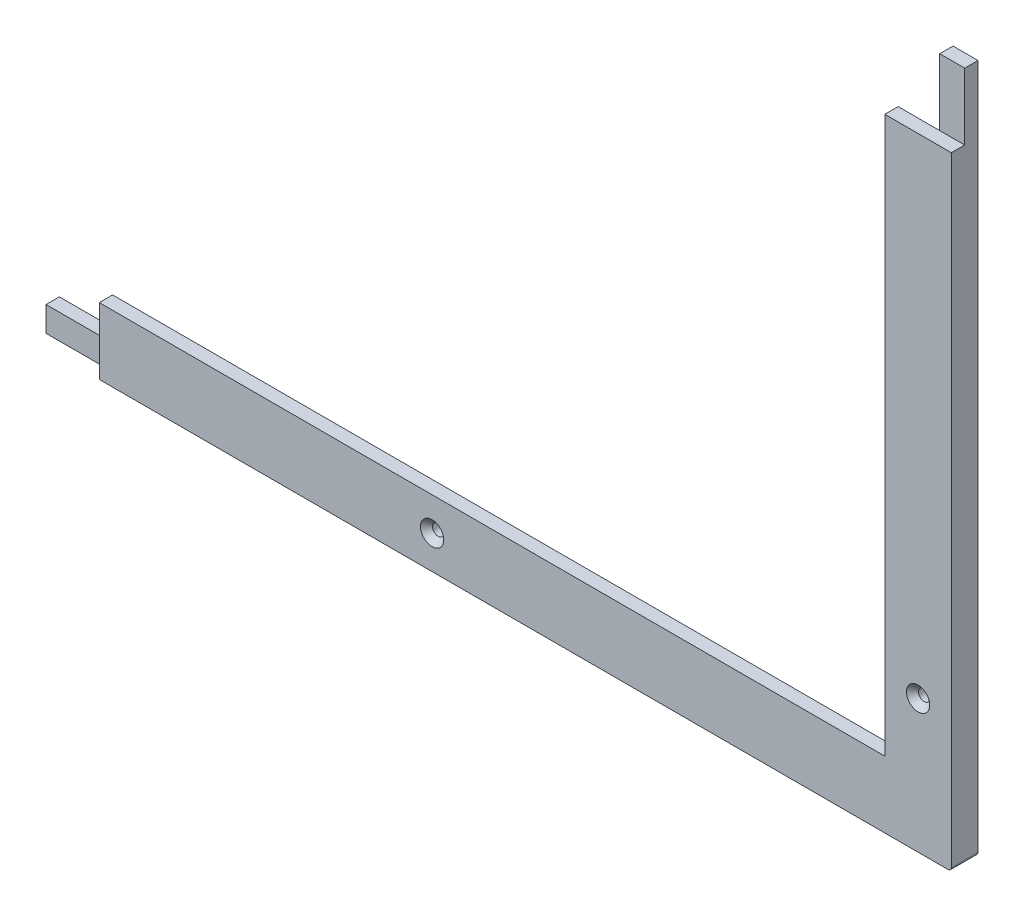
ISO-10303-21;
HEADER;
FILE_DESCRIPTION(('STEP AP214'),'2;1');
FILE_NAME('part.step','',(''),(''),'','','');
FILE_SCHEMA(('AUTOMOTIVE_DESIGN { 1 0 10303 214 1 1 1 1 }'));
ENDSEC;
DATA;
#1=APPLICATION_CONTEXT('core data for automotive mechanical design processes');
#2=APPLICATION_PROTOCOL_DEFINITION('international standard','automotive_design',2000,#1);
#3=PRODUCT_CONTEXT('',#1,'mechanical');
#4=PRODUCT('Part','Part','',(#3));
#5=PRODUCT_RELATED_PRODUCT_CATEGORY('part','',(#4));
#6=PRODUCT_DEFINITION_FORMATION('','',#4);
#7=PRODUCT_DEFINITION_CONTEXT('part definition',#1,'design');
#8=PRODUCT_DEFINITION('design','',#6,#7);
#9=PRODUCT_DEFINITION_SHAPE('','',#8);
#10=(LENGTH_UNIT() NAMED_UNIT(*) SI_UNIT(.MILLI.,.METRE.));
#11=(NAMED_UNIT(*) PLANE_ANGLE_UNIT() SI_UNIT($,.RADIAN.));
#12=(NAMED_UNIT(*) SI_UNIT($,.STERADIAN.) SOLID_ANGLE_UNIT());
#13=UNCERTAINTY_MEASURE_WITH_UNIT(LENGTH_MEASURE(1.E-05),#10,'distance_accuracy_value','');
#14=(GEOMETRIC_REPRESENTATION_CONTEXT(3) GLOBAL_UNCERTAINTY_ASSIGNED_CONTEXT((#13)) GLOBAL_UNIT_ASSIGNED_CONTEXT((#10,
#11,#12)) REPRESENTATION_CONTEXT('',''));
#15=CARTESIAN_POINT('',(0.,0.,0.));
#16=DIRECTION('',(0.,0.,1.));
#17=DIRECTION('',(1.,0.,0.));
#18=AXIS2_PLACEMENT_3D('',#15,#16,#17);
#19=CARTESIAN_POINT('',(246.,-177.,8.));
#20=DIRECTION('',(-1.,0.,0.));
#21=DIRECTION('',(0.,0.,1.));
#22=AXIS2_PLACEMENT_3D('',#19,#20,#21);
#23=PLANE('',#22);
#24=DIRECTION('',(0.,1.,0.));
#25=VECTOR('',#24,1.);
#26=CARTESIAN_POINT('',(246.,-177.,8.));
#27=LINE('',#26,#25);
#28=CARTESIAN_POINT('',(246.,-177.,8.));
#29=VERTEX_POINT('',#28);
#30=CARTESIAN_POINT('',(246.,-10.,7.99999999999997));
#31=VERTEX_POINT('',#30);
#32=EDGE_CURVE('E245',#29,#31,#27,.T.);
#33=ORIENTED_EDGE('',*,*,#32,.T.);
#34=DIRECTION('',(0.,0.,-1.));
#35=VECTOR('',#34,1.);
#36=CARTESIAN_POINT('',(246.,-10.,8.00000000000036));
#37=LINE('',#36,#35);
#38=CARTESIAN_POINT('',(246.,-10.,4.));
#39=VERTEX_POINT('',#38);
#40=EDGE_CURVE('E217',#31,#39,#37,.T.);
#41=ORIENTED_EDGE('',*,*,#40,.T.);
#42=DIRECTION('',(0.,-1.,0.));
#43=VECTOR('',#42,1.);
#44=CARTESIAN_POINT('',(246.,-177.,4.));
#45=LINE('',#44,#43);
#46=CARTESIAN_POINT('',(246.,-177.,4.));
#47=VERTEX_POINT('',#46);
#48=EDGE_CURVE('E242',#39,#47,#45,.T.);
#49=ORIENTED_EDGE('',*,*,#48,.T.);
#50=DIRECTION('',(0.,0.,-1.));
#51=VECTOR('',#50,1.);
#52=CARTESIAN_POINT('',(246.,-177.,8.));
#53=LINE('',#52,#51);
#54=EDGE_CURVE('E178',#29,#47,#53,.T.);
#55=ORIENTED_EDGE('',*,*,#54,.F.);
#56=EDGE_LOOP('',(#33,#41,#49,#55));
#57=FACE_BOUND('',#56,.T.);
#58=ADVANCED_FACE('F38',(#57),#23,.T.);
#59=CARTESIAN_POINT('',(0.,0.,8.));
#60=DIRECTION('',(0.,0.,-1.));
#61=DIRECTION('',(-1.,0.,0.));
#62=AXIS2_PLACEMENT_3D('',#59,#60,#61);
#63=PLANE('',#62);
#64=CARTESIAN_POINT('',(256.,-157.,8.));
#65=DIRECTION('',(0.,0.,1.));
#66=DIRECTION('',(1.,0.,0.));
#67=AXIS2_PLACEMENT_3D('',#64,#65,#66);
#68=CIRCLE('',#67,3.5);
#69=CARTESIAN_POINT('',(259.5,-157.,8.));
#70=VERTEX_POINT('',#69);
#71=EDGE_CURVE('E200',#70,#70,#68,.T.);
#72=ORIENTED_EDGE('',*,*,#71,.F.);
#73=EDGE_LOOP('',(#72));
#74=FACE_BOUND('',#73,.T.);
#75=CARTESIAN_POINT('',(110.,-187.,8.));
#76=DIRECTION('',(0.,0.,1.));
#77=DIRECTION('',(1.,0.,0.));
#78=AXIS2_PLACEMENT_3D('',#75,#76,#77);
#79=CIRCLE('',#78,3.5);
#80=CARTESIAN_POINT('',(113.5,-187.,8.));
#81=VERTEX_POINT('',#80);
#82=EDGE_CURVE('E210',#81,#81,#79,.T.);
#83=ORIENTED_EDGE('',*,*,#82,.F.);
#84=EDGE_LOOP('',(#83));
#85=FACE_BOUND('',#84,.T.);
#86=DIRECTION('',(1.,0.,0.));
#87=VECTOR('',#86,1.);
#88=CARTESIAN_POINT('',(-246.,-177.,8.));
#89=LINE('',#88,#87);
#90=CARTESIAN_POINT('',(9.99999999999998,-177.,8.));
#91=VERTEX_POINT('',#90);
#92=EDGE_CURVE('E150',#91,#29,#89,.T.);
#93=ORIENTED_EDGE('',*,*,#92,.F.);
#94=DIRECTION('',(0.,1.,0.));
#95=VECTOR('',#94,1.);
#96=CARTESIAN_POINT('',(9.99999999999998,-197.,8.));
#97=LINE('',#96,#95);
#98=CARTESIAN_POINT('',(9.99999999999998,-197.,8.));
#99=VERTEX_POINT('',#98);
#100=EDGE_CURVE('E136',#99,#91,#97,.T.);
#101=ORIENTED_EDGE('',*,*,#100,.F.);
#102=DIRECTION('',(1.,0.,0.));
#103=VECTOR('',#102,1.);
#104=CARTESIAN_POINT('',(-266.,-197.,8.));
#105=LINE('',#104,#103);
#106=CARTESIAN_POINT('',(265.,-197.,8.));
#107=VERTEX_POINT('',#106);
#108=EDGE_CURVE('E147',#99,#107,#105,.T.);
#109=ORIENTED_EDGE('',*,*,#108,.T.);
#110=CARTESIAN_POINT('',(265.,-196.,8.));
#111=DIRECTION('',(0.,0.,-1.));
#112=DIRECTION('',(-1.,0.,0.));
#113=AXIS2_PLACEMENT_3D('',#110,#111,#112);
#114=CIRCLE('',#113,1.);
#115=CARTESIAN_POINT('',(266.,-196.,8.));
#116=VERTEX_POINT('',#115);
#117=EDGE_CURVE('E167',#107,#116,#114,.F.);
#118=ORIENTED_EDGE('',*,*,#117,.T.);
#119=DIRECTION('',(0.,1.,0.));
#120=VECTOR('',#119,1.);
#121=CARTESIAN_POINT('',(266.,-197.,8.));
#122=LINE('',#121,#120);
#123=CARTESIAN_POINT('',(266.,-10.,7.99999999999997));
#124=VERTEX_POINT('',#123);
#125=EDGE_CURVE('E161',#116,#124,#122,.T.);
#126=ORIENTED_EDGE('',*,*,#125,.T.);
#127=DIRECTION('',(-1.,0.,0.));
#128=VECTOR('',#127,1.);
#129=CARTESIAN_POINT('',(266.,-10.,7.99999999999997));
#130=LINE('',#129,#128);
#131=EDGE_CURVE('E261',#124,#31,#130,.T.);
#132=ORIENTED_EDGE('',*,*,#131,.T.);
#133=ORIENTED_EDGE('',*,*,#32,.F.);
#134=EDGE_LOOP('',(#93,#101,#109,#118,#126,#132,#133));
#135=FACE_BOUND('',#134,.T.);
#136=ADVANCED_FACE('F146',(#74,#85,#135),#63,.F.);
#137=CARTESIAN_POINT('',(0.,0.,0.));
#138=DIRECTION('',(0.,0.,-1.));
#139=DIRECTION('',(-1.,0.,0.));
#140=AXIS2_PLACEMENT_3D('',#137,#138,#139);
#141=PLANE('',#140);
#142=DIRECTION('',(0.,1.,0.));
#143=VECTOR('',#142,1.);
#144=CARTESIAN_POINT('',(-10.,-197.,0.));
#145=LINE('',#144,#143);
#146=CARTESIAN_POINT('',(-10.,-197.,0.));
#147=VERTEX_POINT('',#146);
#148=CARTESIAN_POINT('',(-10.,-189.5,0.));
#149=VERTEX_POINT('',#148);
#150=EDGE_CURVE('E299',#147,#149,#145,.T.);
#151=ORIENTED_EDGE('',*,*,#150,.T.);
#152=DIRECTION('',(-1.,0.,0.));
#153=VECTOR('',#152,1.);
#154=CARTESIAN_POINT('',(258.5,-189.5,0.));
#155=LINE('',#154,#153);
#156=CARTESIAN_POINT('',(258.5,-189.5,0.));
#157=VERTEX_POINT('',#156);
#158=EDGE_CURVE('E228',#157,#149,#155,.T.);
#159=ORIENTED_EDGE('',*,*,#158,.F.);
#160=DIRECTION('',(0.,-1.,0.));
#161=VECTOR('',#160,1.);
#162=CARTESIAN_POINT('',(258.5,189.5,0.));
#163=LINE('',#162,#161);
#164=CARTESIAN_POINT('',(258.5,10.,0.));
#165=VERTEX_POINT('',#164);
#166=EDGE_CURVE('E195',#165,#157,#163,.T.);
#167=ORIENTED_EDGE('',*,*,#166,.F.);
#168=DIRECTION('',(-1.,0.,0.));
#169=VECTOR('',#168,1.);
#170=CARTESIAN_POINT('',(266.,10.,0.));
#171=LINE('',#170,#169);
#172=CARTESIAN_POINT('',(266.,10.,0.));
#173=VERTEX_POINT('',#172);
#174=EDGE_CURVE('E308',#173,#165,#171,.T.);
#175=ORIENTED_EDGE('',*,*,#174,.F.);
#176=DIRECTION('',(0.,1.,0.));
#177=VECTOR('',#176,1.);
#178=CARTESIAN_POINT('',(266.,-197.,0.));
#179=LINE('',#178,#177);
#180=CARTESIAN_POINT('',(266.,-196.,0.));
#181=VERTEX_POINT('',#180);
#182=EDGE_CURVE('E174',#181,#173,#179,.T.);
#183=ORIENTED_EDGE('',*,*,#182,.F.);
#184=CARTESIAN_POINT('',(265.,-196.,0.));
#185=DIRECTION('',(0.,0.,-1.));
#186=DIRECTION('',(-1.,0.,0.));
#187=AXIS2_PLACEMENT_3D('',#184,#185,#186);
#188=CIRCLE('',#187,1.);
#189=CARTESIAN_POINT('',(265.,-197.,0.));
#190=VERTEX_POINT('',#189);
#191=EDGE_CURVE('E160',#181,#190,#188,.T.);
#192=ORIENTED_EDGE('',*,*,#191,.T.);
#193=DIRECTION('',(1.,0.,0.));
#194=VECTOR('',#193,1.);
#195=CARTESIAN_POINT('',(-266.,-197.,0.));
#196=LINE('',#195,#194);
#197=EDGE_CURVE('E170',#147,#190,#196,.T.);
#198=ORIENTED_EDGE('',*,*,#197,.F.);
#199=EDGE_LOOP('',(#151,#159,#167,#175,#183,#192,#198));
#200=FACE_BOUND('',#199,.T.);
#201=ADVANCED_FACE('F339',(#200),#141,.T.);
#202=CARTESIAN_POINT('',(266.,-197.,8.));
#203=DIRECTION('',(-1.,0.,0.));
#204=DIRECTION('',(0.,0.,1.));
#205=AXIS2_PLACEMENT_3D('',#202,#203,#204);
#206=PLANE('',#205);
#207=DIRECTION('',(0.,0.,-1.));
#208=VECTOR('',#207,1.);
#209=CARTESIAN_POINT('',(266.,-10.,7.99999999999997));
#210=LINE('',#209,#208);
#211=CARTESIAN_POINT('',(266.,-10.,4.));
#212=VERTEX_POINT('',#211);
#213=EDGE_CURVE('E298',#124,#212,#210,.T.);
#214=ORIENTED_EDGE('',*,*,#213,.F.);
#215=ORIENTED_EDGE('',*,*,#125,.F.);
#216=DIRECTION('',(0.,0.,-1.));
#217=VECTOR('',#216,1.);
#218=CARTESIAN_POINT('',(266.,-196.,8.));
#219=LINE('',#218,#217);
#220=EDGE_CURVE('E185',#116,#181,#219,.T.);
#221=ORIENTED_EDGE('',*,*,#220,.T.);
#222=ORIENTED_EDGE('',*,*,#182,.T.);
#223=DIRECTION('',(0.,0.,-1.));
#224=VECTOR('',#223,1.);
#225=CARTESIAN_POINT('',(266.,10.,4.));
#226=LINE('',#225,#224);
#227=CARTESIAN_POINT('',(266.,10.,4.));
#228=VERTEX_POINT('',#227);
#229=EDGE_CURVE('E305',#228,#173,#226,.T.);
#230=ORIENTED_EDGE('',*,*,#229,.F.);
#231=DIRECTION('',(0.,1.,0.));
#232=VECTOR('',#231,1.);
#233=CARTESIAN_POINT('',(266.,-10.,4.));
#234=LINE('',#233,#232);
#235=EDGE_CURVE('E302',#212,#228,#234,.T.);
#236=ORIENTED_EDGE('',*,*,#235,.F.);
#237=EDGE_LOOP('',(#214,#215,#221,#222,#230,#236));
#238=FACE_BOUND('',#237,.T.);
#239=ADVANCED_FACE('F347',(#238),#206,.F.);
#240=CARTESIAN_POINT('',(258.5,189.5,4.));
#241=DIRECTION('',(1.,0.,0.));
#242=DIRECTION('',(0.,1.,0.));
#243=AXIS2_PLACEMENT_3D('',#240,#241,#242);
#244=PLANE('',#243);
#245=DIRECTION('',(0.,0.,1.));
#246=VECTOR('',#245,1.);
#247=CARTESIAN_POINT('',(258.5,10.,3.99999999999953));
#248=LINE('',#247,#246);
#249=CARTESIAN_POINT('',(258.5,10.,4.));
#250=VERTEX_POINT('',#249);
#251=EDGE_CURVE('E270',#165,#250,#248,.T.);
#252=ORIENTED_EDGE('',*,*,#251,.F.);
#253=ORIENTED_EDGE('',*,*,#166,.T.);
#254=DIRECTION('',(0.,0.,-1.));
#255=VECTOR('',#254,1.);
#256=CARTESIAN_POINT('',(258.5,-189.5,4.));
#257=LINE('',#256,#255);
#258=CARTESIAN_POINT('',(258.5,-189.5,4.));
#259=VERTEX_POINT('',#258);
#260=EDGE_CURVE('E233',#259,#157,#257,.T.);
#261=ORIENTED_EDGE('',*,*,#260,.F.);
#262=DIRECTION('',(0.,-1.,0.));
#263=VECTOR('',#262,1.);
#264=CARTESIAN_POINT('',(258.5,189.5,4.));
#265=LINE('',#264,#263);
#266=CARTESIAN_POINT('',(258.5,-10.,4.));
#267=VERTEX_POINT('',#266);
#268=EDGE_CURVE('E224',#267,#259,#265,.T.);
#269=ORIENTED_EDGE('',*,*,#268,.F.);
#270=DIRECTION('',(0.,-1.,0.));
#271=VECTOR('',#270,1.);
#272=CARTESIAN_POINT('',(258.5,189.5,4.));
#273=LINE('',#272,#271);
#274=EDGE_CURVE('E265',#250,#267,#273,.T.);
#275=ORIENTED_EDGE('',*,*,#274,.F.);
#276=EDGE_LOOP('',(#252,#253,#261,#269,#275));
#277=FACE_BOUND('',#276,.T.);
#278=ADVANCED_FACE('F351',(#277),#244,.F.);
#279=CARTESIAN_POINT('',(0.,0.,4.));
#280=DIRECTION('',(0.,0.,-1.));
#281=DIRECTION('',(-1.,0.,0.));
#282=AXIS2_PLACEMENT_3D('',#279,#280,#281);
#283=PLANE('',#282);
#284=DIRECTION('',(0.,1.,0.));
#285=VECTOR('',#284,1.);
#286=CARTESIAN_POINT('',(10.,-197.,4.));
#287=LINE('',#286,#285);
#288=CARTESIAN_POINT('',(10.,-189.5,4.));
#289=VERTEX_POINT('',#288);
#290=CARTESIAN_POINT('',(10.,-177.,4.));
#291=VERTEX_POINT('',#290);
#292=EDGE_CURVE('E152',#289,#291,#287,.T.);
#293=ORIENTED_EDGE('',*,*,#292,.T.);
#294=DIRECTION('',(-1.,0.,0.));
#295=VECTOR('',#294,1.);
#296=CARTESIAN_POINT('',(-246.,-177.,4.));
#297=LINE('',#296,#295);
#298=EDGE_CURVE('E47',#47,#291,#297,.T.);
#299=ORIENTED_EDGE('',*,*,#298,.F.);
#300=ORIENTED_EDGE('',*,*,#48,.F.);
#301=DIRECTION('',(-1.,0.,0.));
#302=VECTOR('',#301,1.);
#303=CARTESIAN_POINT('',(266.,-10.,4.));
#304=LINE('',#303,#302);
#305=EDGE_CURVE('E272',#267,#39,#304,.T.);
#306=ORIENTED_EDGE('',*,*,#305,.F.);
#307=ORIENTED_EDGE('',*,*,#268,.T.);
#308=DIRECTION('',(-1.,0.,0.));
#309=VECTOR('',#308,1.);
#310=CARTESIAN_POINT('',(258.5,-189.5,4.));
#311=LINE('',#310,#309);
#312=EDGE_CURVE('E229',#259,#289,#311,.T.);
#313=ORIENTED_EDGE('',*,*,#312,.T.);
#314=EDGE_LOOP('',(#293,#299,#300,#306,#307,#313));
#315=FACE_BOUND('',#314,.T.);
#316=CARTESIAN_POINT('',(110.,-187.,4.));
#317=DIRECTION('',(0.,0.,-1.));
#318=DIRECTION('',(-1.,0.,0.));
#319=AXIS2_PLACEMENT_3D('',#316,#317,#318);
#320=CIRCLE('',#319,1.69999999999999);
#321=CARTESIAN_POINT('',(108.3,-187.,4.));
#322=VERTEX_POINT('',#321);
#323=EDGE_CURVE('E197',#322,#322,#320,.T.);
#324=ORIENTED_EDGE('',*,*,#323,.F.);
#325=EDGE_LOOP('',(#324));
#326=FACE_BOUND('',#325,.T.);
#327=CARTESIAN_POINT('',(256.,-157.,4.));
#328=DIRECTION('',(0.,0.,-1.));
#329=DIRECTION('',(-1.,0.,0.));
#330=AXIS2_PLACEMENT_3D('',#327,#328,#329);
#331=CIRCLE('',#330,1.69999999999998);
#332=CARTESIAN_POINT('',(254.3,-157.,4.));
#333=VERTEX_POINT('',#332);
#334=EDGE_CURVE('E192',#333,#333,#331,.T.);
#335=ORIENTED_EDGE('',*,*,#334,.F.);
#336=EDGE_LOOP('',(#335));
#337=FACE_BOUND('',#336,.T.);
#338=ADVANCED_FACE('F282',(#315,#326,#337),#283,.T.);
#339=CARTESIAN_POINT('',(-246.,-177.,8.));
#340=DIRECTION('',(0.,1.,0.));
#341=DIRECTION('',(0.,0.,1.));
#342=AXIS2_PLACEMENT_3D('',#339,#340,#341);
#343=PLANE('',#342);
#344=DIRECTION('',(0.,0.,-1.));
#345=VECTOR('',#344,1.);
#346=CARTESIAN_POINT('',(9.99999999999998,-177.,8.00000000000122));
#347=LINE('',#346,#345);
#348=EDGE_CURVE('E295',#91,#291,#347,.T.);
#349=ORIENTED_EDGE('',*,*,#348,.F.);
#350=ORIENTED_EDGE('',*,*,#92,.T.);
#351=ORIENTED_EDGE('',*,*,#54,.T.);
#352=ORIENTED_EDGE('',*,*,#298,.T.);
#353=EDGE_LOOP('',(#349,#350,#351,#352));
#354=FACE_BOUND('',#353,.T.);
#355=ADVANCED_FACE('F255',(#354),#343,.T.);
#356=CARTESIAN_POINT('',(-266.,-197.,8.));
#357=DIRECTION('',(0.,1.,0.));
#358=DIRECTION('',(0.,0.,1.));
#359=AXIS2_PLACEMENT_3D('',#356,#357,#358);
#360=PLANE('',#359);
#361=DIRECTION('',(-1.,0.,0.));
#362=VECTOR('',#361,1.);
#363=CARTESIAN_POINT('',(-10.,-197.,4.));
#364=LINE('',#363,#362);
#365=CARTESIAN_POINT('',(10.,-197.,4.));
#366=VERTEX_POINT('',#365);
#367=CARTESIAN_POINT('',(-10.,-197.,4.));
#368=VERTEX_POINT('',#367);
#369=EDGE_CURVE('E142',#366,#368,#364,.T.);
#370=ORIENTED_EDGE('',*,*,#369,.T.);
#371=DIRECTION('',(0.,0.,-1.));
#372=VECTOR('',#371,1.);
#373=CARTESIAN_POINT('',(-10.,-197.,0.));
#374=LINE('',#373,#372);
#375=EDGE_CURVE('E153',#368,#147,#374,.T.);
#376=ORIENTED_EDGE('',*,*,#375,.T.);
#377=ORIENTED_EDGE('',*,*,#197,.T.);
#378=DIRECTION('',(0.,0.,-1.));
#379=VECTOR('',#378,1.);
#380=CARTESIAN_POINT('',(265.,-197.,8.));
#381=LINE('',#380,#379);
#382=EDGE_CURVE('E157',#190,#107,#381,.F.);
#383=ORIENTED_EDGE('',*,*,#382,.T.);
#384=ORIENTED_EDGE('',*,*,#108,.F.);
#385=DIRECTION('',(0.,0.,-1.));
#386=VECTOR('',#385,1.);
#387=CARTESIAN_POINT('',(10.,-197.,4.));
#388=LINE('',#387,#386);
#389=EDGE_CURVE('E133',#99,#366,#388,.T.);
#390=ORIENTED_EDGE('',*,*,#389,.T.);
#391=EDGE_LOOP('',(#370,#376,#377,#383,#384,#390));
#392=FACE_BOUND('',#391,.T.);
#393=ADVANCED_FACE('F155',(#392),#360,.F.);
#394=CARTESIAN_POINT('',(265.,-196.,8.));
#395=DIRECTION('',(0.,0.,-1.));
#396=DIRECTION('',(-1.,0.,0.));
#397=AXIS2_PLACEMENT_3D('',#394,#395,#396);
#398=CYLINDRICAL_SURFACE('',#397,1.);
#399=ORIENTED_EDGE('',*,*,#117,.F.);
#400=ORIENTED_EDGE('',*,*,#382,.F.);
#401=ORIENTED_EDGE('',*,*,#191,.F.);
#402=ORIENTED_EDGE('',*,*,#220,.F.);
#403=EDGE_LOOP('',(#399,#400,#401,#402));
#404=FACE_BOUND('',#403,.T.);
#405=ADVANCED_FACE('F40',(#404),#398,.T.);
#406=CARTESIAN_POINT('',(258.5,-189.5,4.));
#407=DIRECTION('',(0.,-1.,0.));
#408=DIRECTION('',(0.,0.,-1.));
#409=AXIS2_PLACEMENT_3D('',#406,#407,#408);
#410=PLANE('',#409);
#411=ORIENTED_EDGE('',*,*,#158,.T.);
#412=DIRECTION('',(0.,0.,1.));
#413=VECTOR('',#412,1.);
#414=CARTESIAN_POINT('',(-10.,-189.5,4.00000000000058));
#415=LINE('',#414,#413);
#416=CARTESIAN_POINT('',(-10.,-189.5,4.));
#417=VERTEX_POINT('',#416);
#418=EDGE_CURVE('E11',#149,#417,#415,.T.);
#419=ORIENTED_EDGE('',*,*,#418,.T.);
#420=EDGE_CURVE('E227',#289,#417,#311,.T.);
#421=ORIENTED_EDGE('',*,*,#420,.F.);
#422=ORIENTED_EDGE('',*,*,#312,.F.);
#423=ORIENTED_EDGE('',*,*,#260,.T.);
#424=EDGE_LOOP('',(#411,#419,#421,#422,#423));
#425=FACE_BOUND('',#424,.T.);
#426=ADVANCED_FACE('F365',(#425),#410,.F.);
#427=CARTESIAN_POINT('',(256.,-157.,8.));
#428=DIRECTION('',(0.,0.,1.));
#429=DIRECTION('',(1.,0.,0.));
#430=AXIS2_PLACEMENT_3D('',#427,#428,#429);
#431=CYLINDRICAL_SURFACE('',#430,1.69999999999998);
#432=ORIENTED_EDGE('',*,*,#334,.T.);
#433=EDGE_LOOP('',(#432));
#434=FACE_BOUND('',#433,.T.);
#435=CARTESIAN_POINT('',(256.,-157.,6.2));
#436=DIRECTION('',(0.,0.,1.));
#437=DIRECTION('',(1.,0.,0.));
#438=AXIS2_PLACEMENT_3D('',#435,#436,#437);
#439=CIRCLE('',#438,1.69999999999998);
#440=CARTESIAN_POINT('',(257.7,-157.,6.2));
#441=VERTEX_POINT('',#440);
#442=EDGE_CURVE('E196',#441,#441,#439,.T.);
#443=ORIENTED_EDGE('',*,*,#442,.T.);
#444=EDGE_LOOP('',(#443));
#445=FACE_BOUND('',#444,.T.);
#446=ADVANCED_FACE('F490',(#434,#445),#431,.F.);
#447=CARTESIAN_POINT('',(256.,-157.,8.));
#448=DIRECTION('',(0.,0.,1.));
#449=DIRECTION('',(1.,0.,0.));
#450=AXIS2_PLACEMENT_3D('',#447,#448,#449);
#451=CONICAL_SURFACE('',#450,3.5,0.785398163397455);
#452=ORIENTED_EDGE('',*,*,#442,.F.);
#453=EDGE_LOOP('',(#452));
#454=FACE_BOUND('',#453,.T.);
#455=ORIENTED_EDGE('',*,*,#71,.T.);
#456=EDGE_LOOP('',(#455));
#457=FACE_BOUND('',#456,.T.);
#458=ADVANCED_FACE('F482',(#454,#457),#451,.F.);
#459=CARTESIAN_POINT('',(110.,-187.,8.));
#460=DIRECTION('',(0.,0.,1.));
#461=DIRECTION('',(1.,0.,0.));
#462=AXIS2_PLACEMENT_3D('',#459,#460,#461);
#463=CYLINDRICAL_SURFACE('',#462,1.69999999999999);
#464=ORIENTED_EDGE('',*,*,#323,.T.);
#465=EDGE_LOOP('',(#464));
#466=FACE_BOUND('',#465,.T.);
#467=CARTESIAN_POINT('',(110.,-187.,6.2));
#468=DIRECTION('',(0.,0.,1.));
#469=DIRECTION('',(1.,0.,0.));
#470=AXIS2_PLACEMENT_3D('',#467,#468,#469);
#471=CIRCLE('',#470,1.69999999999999);
#472=CARTESIAN_POINT('',(111.7,-187.,6.2));
#473=VERTEX_POINT('',#472);
#474=EDGE_CURVE('E201',#473,#473,#471,.T.);
#475=ORIENTED_EDGE('',*,*,#474,.T.);
#476=EDGE_LOOP('',(#475));
#477=FACE_BOUND('',#476,.T.);
#478=ADVANCED_FACE('F403',(#466,#477),#463,.F.);
#479=CARTESIAN_POINT('',(110.,-187.,8.));
#480=DIRECTION('',(0.,0.,1.));
#481=DIRECTION('',(1.,0.,0.));
#482=AXIS2_PLACEMENT_3D('',#479,#480,#481);
#483=CONICAL_SURFACE('',#482,3.5,0.785398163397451);
#484=ORIENTED_EDGE('',*,*,#474,.F.);
#485=EDGE_LOOP('',(#484));
#486=FACE_BOUND('',#485,.T.);
#487=ORIENTED_EDGE('',*,*,#82,.T.);
#488=EDGE_LOOP('',(#487));
#489=FACE_BOUND('',#488,.T.);
#490=ADVANCED_FACE('F398',(#486,#489),#483,.F.);
#491=CARTESIAN_POINT('',(266.,10.,4.));
#492=DIRECTION('',(0.,1.,0.));
#493=DIRECTION('',(0.,0.,1.));
#494=AXIS2_PLACEMENT_3D('',#491,#492,#493);
#495=PLANE('',#494);
#496=ORIENTED_EDGE('',*,*,#251,.T.);
#497=DIRECTION('',(-1.,0.,0.));
#498=VECTOR('',#497,1.);
#499=CARTESIAN_POINT('',(266.,10.,4.));
#500=LINE('',#499,#498);
#501=EDGE_CURVE('E310',#228,#250,#500,.T.);
#502=ORIENTED_EDGE('',*,*,#501,.F.);
#503=ORIENTED_EDGE('',*,*,#229,.T.);
#504=ORIENTED_EDGE('',*,*,#174,.T.);
#505=EDGE_LOOP('',(#496,#502,#503,#504));
#506=FACE_BOUND('',#505,.T.);
#507=ADVANCED_FACE('F331',(#506),#495,.T.);
#508=CARTESIAN_POINT('',(266.,-10.,4.));
#509=DIRECTION('',(0.,0.,1.));
#510=DIRECTION('',(1.,0.,0.));
#511=AXIS2_PLACEMENT_3D('',#508,#509,#510);
#512=PLANE('',#511);
#513=ORIENTED_EDGE('',*,*,#274,.T.);
#514=EDGE_CURVE('E62',#212,#267,#304,.T.);
#515=ORIENTED_EDGE('',*,*,#514,.F.);
#516=ORIENTED_EDGE('',*,*,#235,.T.);
#517=ORIENTED_EDGE('',*,*,#501,.T.);
#518=EDGE_LOOP('',(#513,#515,#516,#517));
#519=FACE_BOUND('',#518,.T.);
#520=ADVANCED_FACE('F322',(#519),#512,.T.);
#521=CARTESIAN_POINT('',(266.,-10.,7.99999999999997));
#522=DIRECTION('',(0.,1.,0.));
#523=DIRECTION('',(0.,0.,1.));
#524=AXIS2_PLACEMENT_3D('',#521,#522,#523);
#525=PLANE('',#524);
#526=ORIENTED_EDGE('',*,*,#131,.F.);
#527=ORIENTED_EDGE('',*,*,#213,.T.);
#528=ORIENTED_EDGE('',*,*,#514,.T.);
#529=ORIENTED_EDGE('',*,*,#305,.T.);
#530=ORIENTED_EDGE('',*,*,#40,.F.);
#531=EDGE_LOOP('',(#526,#527,#528,#529,#530));
#532=FACE_BOUND('',#531,.T.);
#533=ADVANCED_FACE('F319',(#532),#525,.T.);
#534=CARTESIAN_POINT('',(-10.,-197.,0.));
#535=DIRECTION('',(1.,0.,0.));
#536=DIRECTION('',(0.,0.,-1.));
#537=AXIS2_PLACEMENT_3D('',#534,#535,#536);
#538=PLANE('',#537);
#539=ORIENTED_EDGE('',*,*,#150,.F.);
#540=ORIENTED_EDGE('',*,*,#375,.F.);
#541=DIRECTION('',(0.,1.,0.));
#542=VECTOR('',#541,1.);
#543=CARTESIAN_POINT('',(-10.,-197.,4.));
#544=LINE('',#543,#542);
#545=EDGE_CURVE('E291',#368,#417,#544,.T.);
#546=ORIENTED_EDGE('',*,*,#545,.T.);
#547=ORIENTED_EDGE('',*,*,#418,.F.);
#548=EDGE_LOOP('',(#539,#540,#546,#547));
#549=FACE_BOUND('',#548,.T.);
#550=ADVANCED_FACE('F321',(#549),#538,.F.);
#551=CARTESIAN_POINT('',(-10.,-197.,4.));
#552=DIRECTION('',(0.,0.,-1.));
#553=DIRECTION('',(-1.,0.,0.));
#554=AXIS2_PLACEMENT_3D('',#551,#552,#553);
#555=PLANE('',#554);
#556=ORIENTED_EDGE('',*,*,#545,.F.);
#557=ORIENTED_EDGE('',*,*,#369,.F.);
#558=EDGE_CURVE('E54',#366,#289,#287,.T.);
#559=ORIENTED_EDGE('',*,*,#558,.T.);
#560=ORIENTED_EDGE('',*,*,#420,.T.);
#561=EDGE_LOOP('',(#556,#557,#559,#560));
#562=FACE_BOUND('',#561,.T.);
#563=ADVANCED_FACE('F328',(#562),#555,.F.);
#564=CARTESIAN_POINT('',(10.,-197.,4.));
#565=DIRECTION('',(1.,0.,0.));
#566=DIRECTION('',(0.,0.,-1.));
#567=AXIS2_PLACEMENT_3D('',#564,#565,#566);
#568=PLANE('',#567);
#569=ORIENTED_EDGE('',*,*,#348,.T.);
#570=ORIENTED_EDGE('',*,*,#292,.F.);
#571=ORIENTED_EDGE('',*,*,#558,.F.);
#572=ORIENTED_EDGE('',*,*,#389,.F.);
#573=ORIENTED_EDGE('',*,*,#100,.T.);
#574=EDGE_LOOP('',(#569,#570,#571,#572,#573));
#575=FACE_BOUND('',#574,.T.);
#576=ADVANCED_FACE('F135',(#575),#568,.F.);
#577=CLOSED_SHELL('',(#58,#136,#201,#239,#278,#338,#355,#393,#405,#426,#446,#458,#478,#490,#507,
#520,#533,#550,#563,#576));
#578=MANIFOLD_SOLID_BREP('B2',#577);
#579=ADVANCED_BREP_SHAPE_REPRESENTATION('',(#18,#578),#14);
#580=SHAPE_DEFINITION_REPRESENTATION(#9,#579);
ENDSEC;
END-ISO-10303-21;
